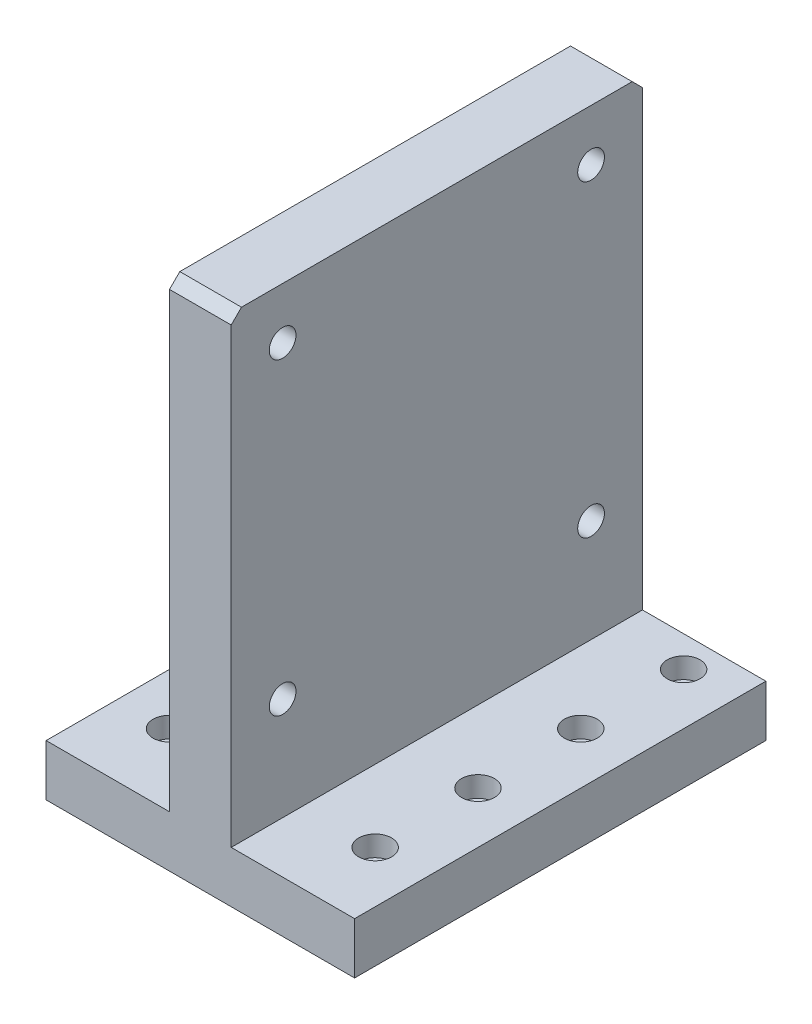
ISO-10303-21;
HEADER;
FILE_DESCRIPTION(('STEP AP214'),'2;1');
FILE_NAME('part.step','',(''),(''),'','','');
FILE_SCHEMA(('AUTOMOTIVE_DESIGN { 1 0 10303 214 1 1 1 1 }'));
ENDSEC;
DATA;
#1=APPLICATION_CONTEXT('core data for automotive mechanical design processes');
#2=APPLICATION_PROTOCOL_DEFINITION('international standard','automotive_design',2000,#1);
#3=PRODUCT_CONTEXT('',#1,'mechanical');
#4=PRODUCT('Part','Part','',(#3));
#5=PRODUCT_RELATED_PRODUCT_CATEGORY('part','',(#4));
#6=PRODUCT_DEFINITION_FORMATION('','',#4);
#7=PRODUCT_DEFINITION_CONTEXT('part definition',#1,'design');
#8=PRODUCT_DEFINITION('design','',#6,#7);
#9=PRODUCT_DEFINITION_SHAPE('','',#8);
#10=(LENGTH_UNIT() NAMED_UNIT(*) SI_UNIT(.MILLI.,.METRE.));
#11=(NAMED_UNIT(*) PLANE_ANGLE_UNIT() SI_UNIT($,.RADIAN.));
#12=(NAMED_UNIT(*) SI_UNIT($,.STERADIAN.) SOLID_ANGLE_UNIT());
#13=UNCERTAINTY_MEASURE_WITH_UNIT(LENGTH_MEASURE(1.E-05),#10,'distance_accuracy_value','');
#14=(GEOMETRIC_REPRESENTATION_CONTEXT(3) GLOBAL_UNCERTAINTY_ASSIGNED_CONTEXT((#13)) GLOBAL_UNIT_ASSIGNED_CONTEXT((#10,
#11,#12)) REPRESENTATION_CONTEXT('',''));
#15=CARTESIAN_POINT('',(0.,0.,0.));
#16=DIRECTION('',(0.,0.,1.));
#17=DIRECTION('',(1.,0.,0.));
#18=AXIS2_PLACEMENT_3D('',#15,#16,#17);
#19=CARTESIAN_POINT('',(75.,0.,200.));
#20=DIRECTION('',(0.,1.,0.));
#21=DIRECTION('',(-1.,0.,0.));
#22=AXIS2_PLACEMENT_3D('',#19,#20,#21);
#23=PLANE('',#22);
#24=CARTESIAN_POINT('',(0.,0.,90.));
#25=DIRECTION('',(0.,1.,0.));
#26=DIRECTION('',(0.,0.,1.));
#27=AXIS2_PLACEMENT_3D('',#24,#25,#26);
#28=CIRCLE('',#27,10.);
#29=CARTESIAN_POINT('',(0.,0.,100.));
#30=VERTEX_POINT('',#29);
#31=EDGE_CURVE('E148',#30,#30,#28,.T.);
#32=ORIENTED_EDGE('',*,*,#31,.T.);
#33=EDGE_LOOP('',(#32));
#34=FACE_BOUND('',#33,.T.);
#35=CARTESIAN_POINT('',(50.,0.,65.));
#36=DIRECTION('',(0.,1.,0.));
#37=DIRECTION('',(0.,0.,1.));
#38=AXIS2_PLACEMENT_3D('',#35,#36,#37);
#39=CIRCLE('',#38,5.00000000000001);
#40=CARTESIAN_POINT('',(50.,0.,70.));
#41=VERTEX_POINT('',#40);
#42=EDGE_CURVE('E305',#41,#41,#39,.T.);
#43=ORIENTED_EDGE('',*,*,#42,.T.);
#44=EDGE_LOOP('',(#43));
#45=FACE_BOUND('',#44,.T.);
#46=CARTESIAN_POINT('',(50.,0.,165.));
#47=DIRECTION('',(0.,1.,0.));
#48=DIRECTION('',(0.,0.,1.));
#49=AXIS2_PLACEMENT_3D('',#46,#47,#48);
#50=CIRCLE('',#49,5.00000000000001);
#51=CARTESIAN_POINT('',(50.,0.,170.));
#52=VERTEX_POINT('',#51);
#53=EDGE_CURVE('E311',#52,#52,#50,.T.);
#54=ORIENTED_EDGE('',*,*,#53,.T.);
#55=EDGE_LOOP('',(#54));
#56=FACE_BOUND('',#55,.T.);
#57=CARTESIAN_POINT('',(-50.,0.,115.));
#58=DIRECTION('',(0.,1.,0.));
#59=DIRECTION('',(0.,0.,1.));
#60=AXIS2_PLACEMENT_3D('',#57,#58,#59);
#61=CIRCLE('',#60,5.);
#62=CARTESIAN_POINT('',(-50.,0.,120.));
#63=VERTEX_POINT('',#62);
#64=EDGE_CURVE('E317',#63,#63,#61,.T.);
#65=ORIENTED_EDGE('',*,*,#64,.T.);
#66=EDGE_LOOP('',(#65));
#67=FACE_BOUND('',#66,.T.);
#68=CARTESIAN_POINT('',(-50.,0.,15.));
#69=DIRECTION('',(0.,1.,0.));
#70=DIRECTION('',(0.,0.,1.));
#71=AXIS2_PLACEMENT_3D('',#68,#69,#70);
#72=CIRCLE('',#71,5.);
#73=CARTESIAN_POINT('',(-50.,0.,20.));
#74=VERTEX_POINT('',#73);
#75=EDGE_CURVE('E220',#74,#74,#72,.T.);
#76=ORIENTED_EDGE('',*,*,#75,.T.);
#77=EDGE_LOOP('',(#76));
#78=FACE_BOUND('',#77,.T.);
#79=CARTESIAN_POINT('',(-50.,0.,65.));
#80=DIRECTION('',(0.,1.,0.));
#81=DIRECTION('',(0.,0.,1.));
#82=AXIS2_PLACEMENT_3D('',#79,#80,#81);
#83=CIRCLE('',#82,5.);
#84=CARTESIAN_POINT('',(-50.,0.,70.));
#85=VERTEX_POINT('',#84);
#86=EDGE_CURVE('E320',#85,#85,#83,.T.);
#87=ORIENTED_EDGE('',*,*,#86,.T.);
#88=EDGE_LOOP('',(#87));
#89=FACE_BOUND('',#88,.T.);
#90=CARTESIAN_POINT('',(-50.,0.,165.));
#91=DIRECTION('',(0.,1.,0.));
#92=DIRECTION('',(0.,0.,1.));
#93=AXIS2_PLACEMENT_3D('',#90,#91,#92);
#94=CIRCLE('',#93,5.);
#95=CARTESIAN_POINT('',(-50.,0.,170.));
#96=VERTEX_POINT('',#95);
#97=EDGE_CURVE('E314',#96,#96,#94,.T.);
#98=ORIENTED_EDGE('',*,*,#97,.T.);
#99=EDGE_LOOP('',(#98));
#100=FACE_BOUND('',#99,.T.);
#101=CARTESIAN_POINT('',(50.,0.,115.));
#102=DIRECTION('',(0.,1.,0.));
#103=DIRECTION('',(0.,0.,1.));
#104=AXIS2_PLACEMENT_3D('',#101,#102,#103);
#105=CIRCLE('',#104,5.00000000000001);
#106=CARTESIAN_POINT('',(50.,0.,120.));
#107=VERTEX_POINT('',#106);
#108=EDGE_CURVE('E308',#107,#107,#105,.T.);
#109=ORIENTED_EDGE('',*,*,#108,.T.);
#110=EDGE_LOOP('',(#109));
#111=FACE_BOUND('',#110,.T.);
#112=CARTESIAN_POINT('',(50.,0.,15.));
#113=DIRECTION('',(0.,1.,0.));
#114=DIRECTION('',(0.,0.,1.));
#115=AXIS2_PLACEMENT_3D('',#112,#113,#114);
#116=CIRCLE('',#115,5.);
#117=CARTESIAN_POINT('',(50.,0.,20.));
#118=VERTEX_POINT('',#117);
#119=EDGE_CURVE('E238',#118,#118,#116,.T.);
#120=ORIENTED_EDGE('',*,*,#119,.T.);
#121=EDGE_LOOP('',(#120));
#122=FACE_BOUND('',#121,.T.);
#123=DIRECTION('',(0.,0.,1.));
#124=VECTOR('',#123,1.);
#125=CARTESIAN_POINT('',(-10.,0.,0.));
#126=LINE('',#125,#124);
#127=CARTESIAN_POINT('',(-10.,0.,0.));
#128=VERTEX_POINT('',#127);
#129=CARTESIAN_POINT('',(-10.,0.,30.));
#130=VERTEX_POINT('',#129);
#131=EDGE_CURVE('E130',#128,#130,#126,.T.);
#132=ORIENTED_EDGE('',*,*,#131,.T.);
#133=CARTESIAN_POINT('',(0.,0.,30.));
#134=DIRECTION('',(0.,1.,0.));
#135=DIRECTION('',(0.,0.,1.));
#136=AXIS2_PLACEMENT_3D('',#133,#134,#135);
#137=CIRCLE('',#136,10.);
#138=CARTESIAN_POINT('',(10.,0.,30.));
#139=VERTEX_POINT('',#138);
#140=EDGE_CURVE('E138',#130,#139,#137,.T.);
#141=ORIENTED_EDGE('',*,*,#140,.T.);
#142=DIRECTION('',(0.,0.,-1.));
#143=VECTOR('',#142,1.);
#144=CARTESIAN_POINT('',(10.,0.,0.));
#145=LINE('',#144,#143);
#146=CARTESIAN_POINT('',(10.,0.,0.));
#147=VERTEX_POINT('',#146);
#148=EDGE_CURVE('E378',#139,#147,#145,.T.);
#149=ORIENTED_EDGE('',*,*,#148,.T.);
#150=DIRECTION('',(1.,0.,0.));
#151=VECTOR('',#150,1.);
#152=CARTESIAN_POINT('',(75.,0.,0.));
#153=LINE('',#152,#151);
#154=CARTESIAN_POINT('',(75.,0.,0.));
#155=VERTEX_POINT('',#154);
#156=EDGE_CURVE('E155',#147,#155,#153,.T.);
#157=ORIENTED_EDGE('',*,*,#156,.T.);
#158=DIRECTION('',(0.,0.,-1.));
#159=VECTOR('',#158,1.);
#160=CARTESIAN_POINT('',(75.,0.,200.));
#161=LINE('',#160,#159);
#162=CARTESIAN_POINT('',(75.,0.,200.));
#163=VERTEX_POINT('',#162);
#164=EDGE_CURVE('E193',#163,#155,#161,.T.);
#165=ORIENTED_EDGE('',*,*,#164,.F.);
#166=DIRECTION('',(1.,0.,0.));
#167=VECTOR('',#166,1.);
#168=CARTESIAN_POINT('',(75.,0.,200.));
#169=LINE('',#168,#167);
#170=CARTESIAN_POINT('',(-75.,0.,200.));
#171=VERTEX_POINT('',#170);
#172=EDGE_CURVE('E172',#171,#163,#169,.T.);
#173=ORIENTED_EDGE('',*,*,#172,.F.);
#174=DIRECTION('',(0.,0.,-1.));
#175=VECTOR('',#174,1.);
#176=CARTESIAN_POINT('',(-75.,0.,200.));
#177=LINE('',#176,#175);
#178=CARTESIAN_POINT('',(-75.,0.,0.));
#179=VERTEX_POINT('',#178);
#180=EDGE_CURVE('E153',#171,#179,#177,.T.);
#181=ORIENTED_EDGE('',*,*,#180,.T.);
#182=EDGE_CURVE('E144',#179,#128,#153,.T.);
#183=ORIENTED_EDGE('',*,*,#182,.T.);
#184=EDGE_LOOP('',(#132,#141,#149,#157,#165,#173,#181,#183));
#185=FACE_BOUND('',#184,.T.);
#186=ADVANCED_FACE('F29',(#34,#45,#56,#67,#78,#89,#100,#111,#122,#185),#23,.F.);
#187=CARTESIAN_POINT('',(-15.,250.,0.));
#188=DIRECTION('',(0.,0.,-1.));
#189=DIRECTION('',(-1.,0.,0.));
#190=AXIS2_PLACEMENT_3D('',#187,#188,#189);
#191=PLANE('',#190);
#192=DIRECTION('',(-1.,0.,0.));
#193=VECTOR('',#192,1.);
#194=CARTESIAN_POINT('',(-10.,5.,0.));
#195=LINE('',#194,#193);
#196=CARTESIAN_POINT('',(10.,5.,0.));
#197=VERTEX_POINT('',#196);
#198=CARTESIAN_POINT('',(-10.,5.,0.));
#199=VERTEX_POINT('',#198);
#200=EDGE_CURVE('E147',#197,#199,#195,.T.);
#201=ORIENTED_EDGE('',*,*,#200,.T.);
#202=DIRECTION('',(0.,-1.,0.));
#203=VECTOR('',#202,1.);
#204=CARTESIAN_POINT('',(-10.,5.,0.));
#205=LINE('',#204,#203);
#206=EDGE_CURVE('E46',#199,#128,#205,.T.);
#207=ORIENTED_EDGE('',*,*,#206,.T.);
#208=ORIENTED_EDGE('',*,*,#182,.F.);
#209=DIRECTION('',(0.,-1.,0.));
#210=VECTOR('',#209,1.);
#211=CARTESIAN_POINT('',(-75.,0.,0.));
#212=LINE('',#211,#210);
#213=CARTESIAN_POINT('',(-75.,25.,0.));
#214=VERTEX_POINT('',#213);
#215=EDGE_CURVE('E159',#214,#179,#212,.T.);
#216=ORIENTED_EDGE('',*,*,#215,.F.);
#217=DIRECTION('',(-1.,0.,0.));
#218=VECTOR('',#217,1.);
#219=CARTESIAN_POINT('',(-75.,25.,0.));
#220=LINE('',#219,#218);
#221=CARTESIAN_POINT('',(-15.,25.,0.));
#222=VERTEX_POINT('',#221);
#223=EDGE_CURVE('E334',#222,#214,#220,.T.);
#224=ORIENTED_EDGE('',*,*,#223,.F.);
#225=DIRECTION('',(0.,-1.,0.));
#226=VECTOR('',#225,1.);
#227=CARTESIAN_POINT('',(-15.,25.,0.));
#228=LINE('',#227,#226);
#229=CARTESIAN_POINT('',(-15.,245.,0.));
#230=VERTEX_POINT('',#229);
#231=EDGE_CURVE('E333',#230,#222,#228,.T.);
#232=ORIENTED_EDGE('',*,*,#231,.F.);
#233=DIRECTION('',(1.,0.,0.));
#234=VECTOR('',#233,1.);
#235=CARTESIAN_POINT('',(15.,245.,0.));
#236=LINE('',#235,#234);
#237=CARTESIAN_POINT('',(15.,245.,0.));
#238=VERTEX_POINT('',#237);
#239=EDGE_CURVE('E11',#230,#238,#236,.T.);
#240=ORIENTED_EDGE('',*,*,#239,.T.);
#241=DIRECTION('',(0.,1.,0.));
#242=VECTOR('',#241,1.);
#243=CARTESIAN_POINT('',(15.,250.,0.));
#244=LINE('',#243,#242);
#245=CARTESIAN_POINT('',(15.,25.,0.));
#246=VERTEX_POINT('',#245);
#247=EDGE_CURVE('E164',#246,#238,#244,.T.);
#248=ORIENTED_EDGE('',*,*,#247,.F.);
#249=DIRECTION('',(-1.,0.,0.));
#250=VECTOR('',#249,1.);
#251=CARTESIAN_POINT('',(15.,25.,0.));
#252=LINE('',#251,#250);
#253=CARTESIAN_POINT('',(75.,25.,0.));
#254=VERTEX_POINT('',#253);
#255=EDGE_CURVE('E157',#254,#246,#252,.T.);
#256=ORIENTED_EDGE('',*,*,#255,.F.);
#257=DIRECTION('',(0.,1.,0.));
#258=VECTOR('',#257,1.);
#259=CARTESIAN_POINT('',(75.,25.,0.));
#260=LINE('',#259,#258);
#261=EDGE_CURVE('E154',#155,#254,#260,.T.);
#262=ORIENTED_EDGE('',*,*,#261,.F.);
#263=ORIENTED_EDGE('',*,*,#156,.F.);
#264=DIRECTION('',(0.,-1.,0.));
#265=VECTOR('',#264,1.);
#266=CARTESIAN_POINT('',(10.,5.,0.));
#267=LINE('',#266,#265);
#268=EDGE_CURVE('E379',#197,#147,#267,.T.);
#269=ORIENTED_EDGE('',*,*,#268,.F.);
#270=EDGE_LOOP('',(#201,#207,#208,#216,#224,#232,#240,#248,#256,#262,#263,#269));
#271=FACE_BOUND('',#270,.T.);
#272=ADVANCED_FACE('F142',(#271),#191,.T.);
#273=CARTESIAN_POINT('',(-50.,30.,15.));
#274=DIRECTION('',(0.,-1.,0.));
#275=DIRECTION('',(0.,0.,-1.));
#276=AXIS2_PLACEMENT_3D('',#273,#274,#275);
#277=CYLINDRICAL_SURFACE('',#276,5.);
#278=ORIENTED_EDGE('',*,*,#75,.F.);
#279=EDGE_LOOP('',(#278));
#280=FACE_BOUND('',#279,.T.);
#281=CARTESIAN_POINT('',(-50.,15.,15.));
#282=DIRECTION('',(0.,1.,0.));
#283=DIRECTION('',(-1.,0.,0.));
#284=AXIS2_PLACEMENT_3D('',#281,#282,#283);
#285=CIRCLE('',#284,5.);
#286=CARTESIAN_POINT('',(-55.,15.,15.));
#287=VERTEX_POINT('',#286);
#288=EDGE_CURVE('E33',#287,#287,#285,.T.);
#289=ORIENTED_EDGE('',*,*,#288,.T.);
#290=EDGE_LOOP('',(#289));
#291=FACE_BOUND('',#290,.T.);
#292=ADVANCED_FACE('F404',(#280,#291),#277,.F.);
#293=CARTESIAN_POINT('',(50.,30.,15.));
#294=DIRECTION('',(0.,-1.,0.));
#295=DIRECTION('',(0.,0.,-1.));
#296=AXIS2_PLACEMENT_3D('',#293,#294,#295);
#297=CYLINDRICAL_SURFACE('',#296,5.);
#298=ORIENTED_EDGE('',*,*,#119,.F.);
#299=EDGE_LOOP('',(#298));
#300=FACE_BOUND('',#299,.T.);
#301=CARTESIAN_POINT('',(50.,15.,15.));
#302=DIRECTION('',(0.,1.,0.));
#303=DIRECTION('',(-1.,0.,0.));
#304=AXIS2_PLACEMENT_3D('',#301,#302,#303);
#305=CIRCLE('',#304,5.);
#306=CARTESIAN_POINT('',(45.,15.,15.));
#307=VERTEX_POINT('',#306);
#308=EDGE_CURVE('E264',#307,#307,#305,.T.);
#309=ORIENTED_EDGE('',*,*,#308,.T.);
#310=EDGE_LOOP('',(#309));
#311=FACE_BOUND('',#310,.T.);
#312=ADVANCED_FACE('F472',(#300,#311),#297,.F.);
#313=CARTESIAN_POINT('',(-50.,30.,65.));
#314=DIRECTION('',(0.,-1.,0.));
#315=DIRECTION('',(0.,0.,-1.));
#316=AXIS2_PLACEMENT_3D('',#313,#314,#315);
#317=CYLINDRICAL_SURFACE('',#316,5.);
#318=ORIENTED_EDGE('',*,*,#86,.F.);
#319=EDGE_LOOP('',(#318));
#320=FACE_BOUND('',#319,.T.);
#321=CARTESIAN_POINT('',(-50.,15.,65.));
#322=DIRECTION('',(0.,1.,0.));
#323=DIRECTION('',(-1.,0.,0.));
#324=AXIS2_PLACEMENT_3D('',#321,#322,#323);
#325=CIRCLE('',#324,5.);
#326=CARTESIAN_POINT('',(-55.,15.,65.));
#327=VERTEX_POINT('',#326);
#328=EDGE_CURVE('E260',#327,#327,#325,.T.);
#329=ORIENTED_EDGE('',*,*,#328,.T.);
#330=EDGE_LOOP('',(#329));
#331=FACE_BOUND('',#330,.T.);
#332=ADVANCED_FACE('F475',(#320,#331),#317,.F.);
#333=CARTESIAN_POINT('',(50.,30.,65.));
#334=DIRECTION('',(0.,-1.,0.));
#335=DIRECTION('',(0.,0.,-1.));
#336=AXIS2_PLACEMENT_3D('',#333,#334,#335);
#337=CYLINDRICAL_SURFACE('',#336,5.00000000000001);
#338=ORIENTED_EDGE('',*,*,#42,.F.);
#339=EDGE_LOOP('',(#338));
#340=FACE_BOUND('',#339,.T.);
#341=CARTESIAN_POINT('',(50.,15.,65.));
#342=DIRECTION('',(0.,1.,0.));
#343=DIRECTION('',(-1.,0.,0.));
#344=AXIS2_PLACEMENT_3D('',#341,#342,#343);
#345=CIRCLE('',#344,5.00000000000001);
#346=CARTESIAN_POINT('',(45.,15.,65.));
#347=VERTEX_POINT('',#346);
#348=EDGE_CURVE('E255',#347,#347,#345,.T.);
#349=ORIENTED_EDGE('',*,*,#348,.T.);
#350=EDGE_LOOP('',(#349));
#351=FACE_BOUND('',#350,.T.);
#352=ADVANCED_FACE('F477',(#340,#351),#337,.F.);
#353=CARTESIAN_POINT('',(-50.,30.,115.));
#354=DIRECTION('',(0.,-1.,0.));
#355=DIRECTION('',(0.,0.,-1.));
#356=AXIS2_PLACEMENT_3D('',#353,#354,#355);
#357=CYLINDRICAL_SURFACE('',#356,5.);
#358=ORIENTED_EDGE('',*,*,#64,.F.);
#359=EDGE_LOOP('',(#358));
#360=FACE_BOUND('',#359,.T.);
#361=CARTESIAN_POINT('',(-50.,15.,115.));
#362=DIRECTION('',(0.,1.,0.));
#363=DIRECTION('',(-1.,0.,0.));
#364=AXIS2_PLACEMENT_3D('',#361,#362,#363);
#365=CIRCLE('',#364,5.);
#366=CARTESIAN_POINT('',(-55.,15.,115.));
#367=VERTEX_POINT('',#366);
#368=EDGE_CURVE('E250',#367,#367,#365,.T.);
#369=ORIENTED_EDGE('',*,*,#368,.T.);
#370=EDGE_LOOP('',(#369));
#371=FACE_BOUND('',#370,.T.);
#372=ADVANCED_FACE('F480',(#360,#371),#357,.F.);
#373=CARTESIAN_POINT('',(50.,30.,115.));
#374=DIRECTION('',(0.,-1.,0.));
#375=DIRECTION('',(0.,0.,-1.));
#376=AXIS2_PLACEMENT_3D('',#373,#374,#375);
#377=CYLINDRICAL_SURFACE('',#376,5.00000000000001);
#378=ORIENTED_EDGE('',*,*,#108,.F.);
#379=EDGE_LOOP('',(#378));
#380=FACE_BOUND('',#379,.T.);
#381=CARTESIAN_POINT('',(50.,15.,115.));
#382=DIRECTION('',(0.,1.,0.));
#383=DIRECTION('',(-1.,0.,0.));
#384=AXIS2_PLACEMENT_3D('',#381,#382,#383);
#385=CIRCLE('',#384,5.00000000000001);
#386=CARTESIAN_POINT('',(45.,15.,115.));
#387=VERTEX_POINT('',#386);
#388=EDGE_CURVE('E245',#387,#387,#385,.T.);
#389=ORIENTED_EDGE('',*,*,#388,.T.);
#390=EDGE_LOOP('',(#389));
#391=FACE_BOUND('',#390,.T.);
#392=ADVANCED_FACE('F482',(#380,#391),#377,.F.);
#393=CARTESIAN_POINT('',(-50.,30.,165.));
#394=DIRECTION('',(0.,-1.,0.));
#395=DIRECTION('',(0.,0.,-1.));
#396=AXIS2_PLACEMENT_3D('',#393,#394,#395);
#397=CYLINDRICAL_SURFACE('',#396,5.);
#398=ORIENTED_EDGE('',*,*,#97,.F.);
#399=EDGE_LOOP('',(#398));
#400=FACE_BOUND('',#399,.T.);
#401=CARTESIAN_POINT('',(-50.,15.,165.));
#402=DIRECTION('',(0.,1.,0.));
#403=DIRECTION('',(-1.,0.,0.));
#404=AXIS2_PLACEMENT_3D('',#401,#402,#403);
#405=CIRCLE('',#404,5.);
#406=CARTESIAN_POINT('',(-55.,15.,165.));
#407=VERTEX_POINT('',#406);
#408=EDGE_CURVE('E240',#407,#407,#405,.T.);
#409=ORIENTED_EDGE('',*,*,#408,.T.);
#410=EDGE_LOOP('',(#409));
#411=FACE_BOUND('',#410,.T.);
#412=ADVANCED_FACE('F485',(#400,#411),#397,.F.);
#413=CARTESIAN_POINT('',(50.,30.,165.));
#414=DIRECTION('',(0.,-1.,0.));
#415=DIRECTION('',(0.,0.,-1.));
#416=AXIS2_PLACEMENT_3D('',#413,#414,#415);
#417=CYLINDRICAL_SURFACE('',#416,5.00000000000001);
#418=ORIENTED_EDGE('',*,*,#53,.F.);
#419=EDGE_LOOP('',(#418));
#420=FACE_BOUND('',#419,.T.);
#421=CARTESIAN_POINT('',(50.,15.,165.));
#422=DIRECTION('',(0.,1.,0.));
#423=DIRECTION('',(-1.,0.,0.));
#424=AXIS2_PLACEMENT_3D('',#421,#422,#423);
#425=CIRCLE('',#424,5.00000000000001);
#426=CARTESIAN_POINT('',(45.,15.,165.));
#427=VERTEX_POINT('',#426);
#428=EDGE_CURVE('E235',#427,#427,#425,.T.);
#429=ORIENTED_EDGE('',*,*,#428,.T.);
#430=EDGE_LOOP('',(#429));
#431=FACE_BOUND('',#430,.T.);
#432=ADVANCED_FACE('F440',(#420,#431),#417,.F.);
#433=CARTESIAN_POINT('',(15.,25.,200.));
#434=DIRECTION('',(0.,-1.,0.));
#435=DIRECTION('',(1.,0.,0.));
#436=AXIS2_PLACEMENT_3D('',#433,#434,#435);
#437=PLANE('',#436);
#438=CARTESIAN_POINT('',(50.,25.,15.));
#439=DIRECTION('',(0.,1.,0.));
#440=DIRECTION('',(-1.,0.,0.));
#441=AXIS2_PLACEMENT_3D('',#438,#439,#440);
#442=CIRCLE('',#441,8.);
#443=CARTESIAN_POINT('',(42.,25.,15.));
#444=VERTEX_POINT('',#443);
#445=EDGE_CURVE('E273',#444,#444,#442,.T.);
#446=ORIENTED_EDGE('',*,*,#445,.F.);
#447=EDGE_LOOP('',(#446));
#448=FACE_BOUND('',#447,.T.);
#449=CARTESIAN_POINT('',(50.,25.,65.));
#450=DIRECTION('',(0.,1.,0.));
#451=DIRECTION('',(-1.,0.,0.));
#452=AXIS2_PLACEMENT_3D('',#449,#450,#451);
#453=CIRCLE('',#452,8.);
#454=CARTESIAN_POINT('',(42.,25.,65.));
#455=VERTEX_POINT('',#454);
#456=EDGE_CURVE('E262',#455,#455,#453,.T.);
#457=ORIENTED_EDGE('',*,*,#456,.F.);
#458=EDGE_LOOP('',(#457));
#459=FACE_BOUND('',#458,.T.);
#460=CARTESIAN_POINT('',(50.,25.,115.));
#461=DIRECTION('',(0.,1.,0.));
#462=DIRECTION('',(-1.,0.,0.));
#463=AXIS2_PLACEMENT_3D('',#460,#461,#462);
#464=CIRCLE('',#463,8.);
#465=CARTESIAN_POINT('',(42.,25.,115.));
#466=VERTEX_POINT('',#465);
#467=EDGE_CURVE('E253',#466,#466,#464,.T.);
#468=ORIENTED_EDGE('',*,*,#467,.F.);
#469=EDGE_LOOP('',(#468));
#470=FACE_BOUND('',#469,.T.);
#471=CARTESIAN_POINT('',(50.,25.,165.));
#472=DIRECTION('',(0.,1.,0.));
#473=DIRECTION('',(-1.,0.,0.));
#474=AXIS2_PLACEMENT_3D('',#471,#472,#473);
#475=CIRCLE('',#474,8.);
#476=CARTESIAN_POINT('',(42.,25.,165.));
#477=VERTEX_POINT('',#476);
#478=EDGE_CURVE('E243',#477,#477,#475,.T.);
#479=ORIENTED_EDGE('',*,*,#478,.F.);
#480=EDGE_LOOP('',(#479));
#481=FACE_BOUND('',#480,.T.);
#482=ORIENTED_EDGE('',*,*,#255,.T.);
#483=DIRECTION('',(0.,0.,-1.));
#484=VECTOR('',#483,1.);
#485=CARTESIAN_POINT('',(15.,25.,200.));
#486=LINE('',#485,#484);
#487=CARTESIAN_POINT('',(15.,25.,200.));
#488=VERTEX_POINT('',#487);
#489=EDGE_CURVE('E187',#488,#246,#486,.T.);
#490=ORIENTED_EDGE('',*,*,#489,.F.);
#491=DIRECTION('',(-1.,0.,0.));
#492=VECTOR('',#491,1.);
#493=CARTESIAN_POINT('',(15.,25.,200.));
#494=LINE('',#493,#492);
#495=CARTESIAN_POINT('',(75.,25.,200.));
#496=VERTEX_POINT('',#495);
#497=EDGE_CURVE('E176',#496,#488,#494,.T.);
#498=ORIENTED_EDGE('',*,*,#497,.F.);
#499=DIRECTION('',(0.,0.,-1.));
#500=VECTOR('',#499,1.);
#501=CARTESIAN_POINT('',(75.,25.,200.));
#502=LINE('',#501,#500);
#503=EDGE_CURVE('E190',#496,#254,#502,.T.);
#504=ORIENTED_EDGE('',*,*,#503,.T.);
#505=EDGE_LOOP('',(#482,#490,#498,#504));
#506=FACE_BOUND('',#505,.T.);
#507=ADVANCED_FACE('F370',(#448,#459,#470,#481,#506),#437,.F.);
#508=CARTESIAN_POINT('',(-75.,25.,200.));
#509=DIRECTION('',(0.,-1.,0.));
#510=DIRECTION('',(0.,0.,-1.));
#511=AXIS2_PLACEMENT_3D('',#508,#509,#510);
#512=PLANE('',#511);
#513=CARTESIAN_POINT('',(-50.,25.,15.));
#514=DIRECTION('',(0.,1.,0.));
#515=DIRECTION('',(-1.,0.,0.));
#516=AXIS2_PLACEMENT_3D('',#513,#514,#515);
#517=CIRCLE('',#516,8.);
#518=CARTESIAN_POINT('',(-58.,25.,15.));
#519=VERTEX_POINT('',#518);
#520=EDGE_CURVE('E395',#519,#519,#517,.T.);
#521=ORIENTED_EDGE('',*,*,#520,.F.);
#522=EDGE_LOOP('',(#521));
#523=FACE_BOUND('',#522,.T.);
#524=CARTESIAN_POINT('',(-50.,25.,65.));
#525=DIRECTION('',(0.,1.,0.));
#526=DIRECTION('',(-1.,0.,0.));
#527=AXIS2_PLACEMENT_3D('',#524,#525,#526);
#528=CIRCLE('',#527,8.);
#529=CARTESIAN_POINT('',(-58.,25.,65.));
#530=VERTEX_POINT('',#529);
#531=EDGE_CURVE('E266',#530,#530,#528,.T.);
#532=ORIENTED_EDGE('',*,*,#531,.F.);
#533=EDGE_LOOP('',(#532));
#534=FACE_BOUND('',#533,.T.);
#535=CARTESIAN_POINT('',(-50.,25.,115.));
#536=DIRECTION('',(0.,1.,0.));
#537=DIRECTION('',(-1.,0.,0.));
#538=AXIS2_PLACEMENT_3D('',#535,#536,#537);
#539=CIRCLE('',#538,8.);
#540=CARTESIAN_POINT('',(-58.,25.,115.));
#541=VERTEX_POINT('',#540);
#542=EDGE_CURVE('E258',#541,#541,#539,.T.);
#543=ORIENTED_EDGE('',*,*,#542,.F.);
#544=EDGE_LOOP('',(#543));
#545=FACE_BOUND('',#544,.T.);
#546=CARTESIAN_POINT('',(-50.,25.,165.));
#547=DIRECTION('',(0.,1.,0.));
#548=DIRECTION('',(-1.,0.,0.));
#549=AXIS2_PLACEMENT_3D('',#546,#547,#548);
#550=CIRCLE('',#549,8.);
#551=CARTESIAN_POINT('',(-58.,25.,165.));
#552=VERTEX_POINT('',#551);
#553=EDGE_CURVE('E248',#552,#552,#550,.T.);
#554=ORIENTED_EDGE('',*,*,#553,.F.);
#555=EDGE_LOOP('',(#554));
#556=FACE_BOUND('',#555,.T.);
#557=ORIENTED_EDGE('',*,*,#223,.T.);
#558=DIRECTION('',(0.,0.,-1.));
#559=VECTOR('',#558,1.);
#560=CARTESIAN_POINT('',(-75.,25.,200.));
#561=LINE('',#560,#559);
#562=CARTESIAN_POINT('',(-75.,25.,200.));
#563=VERTEX_POINT('',#562);
#564=EDGE_CURVE('E197',#563,#214,#561,.T.);
#565=ORIENTED_EDGE('',*,*,#564,.F.);
#566=DIRECTION('',(-1.,0.,0.));
#567=VECTOR('',#566,1.);
#568=CARTESIAN_POINT('',(-75.,25.,200.));
#569=LINE('',#568,#567);
#570=CARTESIAN_POINT('',(-15.,25.,200.));
#571=VERTEX_POINT('',#570);
#572=EDGE_CURVE('E168',#571,#563,#569,.T.);
#573=ORIENTED_EDGE('',*,*,#572,.F.);
#574=DIRECTION('',(0.,0.,-1.));
#575=VECTOR('',#574,1.);
#576=CARTESIAN_POINT('',(-15.,25.,200.));
#577=LINE('',#576,#575);
#578=EDGE_CURVE('E200',#571,#222,#577,.T.);
#579=ORIENTED_EDGE('',*,*,#578,.T.);
#580=EDGE_LOOP('',(#557,#565,#573,#579));
#581=FACE_BOUND('',#580,.T.);
#582=ADVANCED_FACE('F343',(#523,#534,#545,#556,#581),#512,.F.);
#583=CARTESIAN_POINT('',(-15.,25.,200.));
#584=DIRECTION('',(1.,0.,0.));
#585=DIRECTION('',(0.,0.,-1.));
#586=AXIS2_PLACEMENT_3D('',#583,#584,#585);
#587=PLANE('',#586);
#588=CARTESIAN_POINT('',(-15.,75.,175.));
#589=DIRECTION('',(1.,0.,0.));
#590=DIRECTION('',(0.,0.,-1.));
#591=AXIS2_PLACEMENT_3D('',#588,#589,#590);
#592=CIRCLE('',#591,6.50000000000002);
#593=CARTESIAN_POINT('',(-15.,75.,168.5));
#594=VERTEX_POINT('',#593);
#595=EDGE_CURVE('E216',#594,#594,#592,.T.);
#596=ORIENTED_EDGE('',*,*,#595,.T.);
#597=EDGE_LOOP('',(#596));
#598=FACE_BOUND('',#597,.T.);
#599=CARTESIAN_POINT('',(-15.,75.,25.));
#600=DIRECTION('',(1.,0.,0.));
#601=DIRECTION('',(0.,0.,-1.));
#602=AXIS2_PLACEMENT_3D('',#599,#600,#601);
#603=CIRCLE('',#602,6.50000000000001);
#604=CARTESIAN_POINT('',(-15.,75.,18.5));
#605=VERTEX_POINT('',#604);
#606=EDGE_CURVE('E212',#605,#605,#603,.T.);
#607=ORIENTED_EDGE('',*,*,#606,.T.);
#608=EDGE_LOOP('',(#607));
#609=FACE_BOUND('',#608,.T.);
#610=CARTESIAN_POINT('',(-15.,225.,175.));
#611=DIRECTION('',(1.,0.,0.));
#612=DIRECTION('',(0.,0.,-1.));
#613=AXIS2_PLACEMENT_3D('',#610,#611,#612);
#614=CIRCLE('',#613,6.50000000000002);
#615=CARTESIAN_POINT('',(-15.,225.,168.5));
#616=VERTEX_POINT('',#615);
#617=EDGE_CURVE('E208',#616,#616,#614,.T.);
#618=ORIENTED_EDGE('',*,*,#617,.T.);
#619=EDGE_LOOP('',(#618));
#620=FACE_BOUND('',#619,.T.);
#621=CARTESIAN_POINT('',(-15.,225.,25.));
#622=DIRECTION('',(1.,0.,0.));
#623=DIRECTION('',(0.,0.,-1.));
#624=AXIS2_PLACEMENT_3D('',#621,#622,#623);
#625=CIRCLE('',#624,6.5);
#626=CARTESIAN_POINT('',(-15.,225.,18.5));
#627=VERTEX_POINT('',#626);
#628=EDGE_CURVE('E207',#627,#627,#625,.T.);
#629=ORIENTED_EDGE('',*,*,#628,.T.);
#630=EDGE_LOOP('',(#629));
#631=FACE_BOUND('',#630,.T.);
#632=DIRECTION('',(0.,-1.,0.));
#633=VECTOR('',#632,1.);
#634=CARTESIAN_POINT('',(-15.,25.,200.));
#635=LINE('',#634,#633);
#636=CARTESIAN_POINT('',(-15.,245.,200.));
#637=VERTEX_POINT('',#636);
#638=EDGE_CURVE('E166',#637,#571,#635,.T.);
#639=ORIENTED_EDGE('',*,*,#638,.F.);
#640=DIRECTION('',(0.,-0.707106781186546,0.707106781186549));
#641=VECTOR('',#640,1.);
#642=CARTESIAN_POINT('',(-15.,245.,200.));
#643=LINE('',#642,#641);
#644=CARTESIAN_POINT('',(-15.,250.,195.));
#645=VERTEX_POINT('',#644);
#646=EDGE_CURVE('E225',#637,#645,#643,.F.);
#647=ORIENTED_EDGE('',*,*,#646,.T.);
#648=DIRECTION('',(0.,0.,-1.));
#649=VECTOR('',#648,1.);
#650=CARTESIAN_POINT('',(-15.,250.,200.));
#651=LINE('',#650,#649);
#652=CARTESIAN_POINT('',(-15.,250.,5.));
#653=VERTEX_POINT('',#652);
#654=EDGE_CURVE('E181',#645,#653,#651,.T.);
#655=ORIENTED_EDGE('',*,*,#654,.T.);
#656=DIRECTION('',(0.,-0.707106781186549,-0.707106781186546));
#657=VECTOR('',#656,1.);
#658=CARTESIAN_POINT('',(-15.,250.,5.));
#659=LINE('',#658,#657);
#660=EDGE_CURVE('E223',#653,#230,#659,.T.);
#661=ORIENTED_EDGE('',*,*,#660,.T.);
#662=ORIENTED_EDGE('',*,*,#231,.T.);
#663=ORIENTED_EDGE('',*,*,#578,.F.);
#664=EDGE_LOOP('',(#639,#647,#655,#661,#662,#663));
#665=FACE_BOUND('',#664,.T.);
#666=ADVANCED_FACE('F31',(#598,#609,#620,#631,#665),#587,.F.);
#667=CARTESIAN_POINT('',(-75.,0.,200.));
#668=DIRECTION('',(1.,0.,0.));
#669=DIRECTION('',(0.,0.,-1.));
#670=AXIS2_PLACEMENT_3D('',#667,#668,#669);
#671=PLANE('',#670);
#672=ORIENTED_EDGE('',*,*,#215,.T.);
#673=ORIENTED_EDGE('',*,*,#180,.F.);
#674=DIRECTION('',(0.,-1.,0.));
#675=VECTOR('',#674,1.);
#676=CARTESIAN_POINT('',(-75.,0.,200.));
#677=LINE('',#676,#675);
#678=EDGE_CURVE('E170',#563,#171,#677,.T.);
#679=ORIENTED_EDGE('',*,*,#678,.F.);
#680=ORIENTED_EDGE('',*,*,#564,.T.);
#681=EDGE_LOOP('',(#672,#673,#679,#680));
#682=FACE_BOUND('',#681,.T.);
#683=ADVANCED_FACE('F339',(#682),#671,.F.);
#684=CARTESIAN_POINT('',(75.,25.,200.));
#685=DIRECTION('',(-1.,0.,0.));
#686=DIRECTION('',(0.,0.,1.));
#687=AXIS2_PLACEMENT_3D('',#684,#685,#686);
#688=PLANE('',#687);
#689=ORIENTED_EDGE('',*,*,#261,.T.);
#690=ORIENTED_EDGE('',*,*,#503,.F.);
#691=DIRECTION('',(0.,1.,0.));
#692=VECTOR('',#691,1.);
#693=CARTESIAN_POINT('',(75.,25.,200.));
#694=LINE('',#693,#692);
#695=EDGE_CURVE('E174',#163,#496,#694,.T.);
#696=ORIENTED_EDGE('',*,*,#695,.F.);
#697=ORIENTED_EDGE('',*,*,#164,.T.);
#698=EDGE_LOOP('',(#689,#690,#696,#697));
#699=FACE_BOUND('',#698,.T.);
#700=ADVANCED_FACE('F374',(#699),#688,.F.);
#701=CARTESIAN_POINT('',(15.,250.,200.));
#702=DIRECTION('',(-1.,0.,0.));
#703=DIRECTION('',(0.,-1.,0.));
#704=AXIS2_PLACEMENT_3D('',#701,#702,#703);
#705=PLANE('',#704);
#706=CARTESIAN_POINT('',(15.,75.,175.));
#707=DIRECTION('',(-1.,0.,0.));
#708=DIRECTION('',(0.,-1.,0.));
#709=AXIS2_PLACEMENT_3D('',#706,#707,#708);
#710=CIRCLE('',#709,6.50000000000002);
#711=CARTESIAN_POINT('',(15.,68.5,175.));
#712=VERTEX_POINT('',#711);
#713=EDGE_CURVE('E217',#712,#712,#710,.T.);
#714=ORIENTED_EDGE('',*,*,#713,.T.);
#715=EDGE_LOOP('',(#714));
#716=FACE_BOUND('',#715,.T.);
#717=CARTESIAN_POINT('',(15.,75.,25.));
#718=DIRECTION('',(-1.,0.,0.));
#719=DIRECTION('',(0.,-1.,0.));
#720=AXIS2_PLACEMENT_3D('',#717,#718,#719);
#721=CIRCLE('',#720,6.50000000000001);
#722=CARTESIAN_POINT('',(15.,68.5,25.));
#723=VERTEX_POINT('',#722);
#724=EDGE_CURVE('E213',#723,#723,#721,.T.);
#725=ORIENTED_EDGE('',*,*,#724,.T.);
#726=EDGE_LOOP('',(#725));
#727=FACE_BOUND('',#726,.T.);
#728=CARTESIAN_POINT('',(15.,225.,175.));
#729=DIRECTION('',(-1.,0.,0.));
#730=DIRECTION('',(0.,-1.,0.));
#731=AXIS2_PLACEMENT_3D('',#728,#729,#730);
#732=CIRCLE('',#731,6.50000000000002);
#733=CARTESIAN_POINT('',(15.,218.5,175.));
#734=VERTEX_POINT('',#733);
#735=EDGE_CURVE('E209',#734,#734,#732,.T.);
#736=ORIENTED_EDGE('',*,*,#735,.T.);
#737=EDGE_LOOP('',(#736));
#738=FACE_BOUND('',#737,.T.);
#739=CARTESIAN_POINT('',(15.,225.,25.));
#740=DIRECTION('',(-1.,0.,0.));
#741=DIRECTION('',(0.,-1.,0.));
#742=AXIS2_PLACEMENT_3D('',#739,#740,#741);
#743=CIRCLE('',#742,6.5);
#744=CARTESIAN_POINT('',(15.,218.5,25.));
#745=VERTEX_POINT('',#744);
#746=EDGE_CURVE('E204',#745,#745,#743,.T.);
#747=ORIENTED_EDGE('',*,*,#746,.T.);
#748=EDGE_LOOP('',(#747));
#749=FACE_BOUND('',#748,.T.);
#750=DIRECTION('',(0.,0.,-1.));
#751=VECTOR('',#750,1.);
#752=CARTESIAN_POINT('',(15.,250.,200.));
#753=LINE('',#752,#751);
#754=CARTESIAN_POINT('',(15.,250.,195.));
#755=VERTEX_POINT('',#754);
#756=CARTESIAN_POINT('',(15.,250.,5.));
#757=VERTEX_POINT('',#756);
#758=EDGE_CURVE('E184',#755,#757,#753,.T.);
#759=ORIENTED_EDGE('',*,*,#758,.F.);
#760=DIRECTION('',(0.,0.707106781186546,-0.707106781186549));
#761=VECTOR('',#760,1.);
#762=CARTESIAN_POINT('',(15.,245.,200.));
#763=LINE('',#762,#761);
#764=CARTESIAN_POINT('',(15.,245.,200.));
#765=VERTEX_POINT('',#764);
#766=EDGE_CURVE('E38',#755,#765,#763,.F.);
#767=ORIENTED_EDGE('',*,*,#766,.T.);
#768=DIRECTION('',(0.,1.,0.));
#769=VECTOR('',#768,1.);
#770=CARTESIAN_POINT('',(15.,250.,200.));
#771=LINE('',#770,#769);
#772=EDGE_CURVE('E178',#488,#765,#771,.T.);
#773=ORIENTED_EDGE('',*,*,#772,.F.);
#774=ORIENTED_EDGE('',*,*,#489,.T.);
#775=ORIENTED_EDGE('',*,*,#247,.T.);
#776=DIRECTION('',(0.,0.707106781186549,0.707106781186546));
#777=VECTOR('',#776,1.);
#778=CARTESIAN_POINT('',(15.,250.,5.00000000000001));
#779=LINE('',#778,#777);
#780=EDGE_CURVE('E232',#238,#757,#779,.T.);
#781=ORIENTED_EDGE('',*,*,#780,.T.);
#782=EDGE_LOOP('',(#759,#767,#773,#774,#775,#781));
#783=FACE_BOUND('',#782,.T.);
#784=ADVANCED_FACE('F357',(#716,#727,#738,#749,#783),#705,.F.);
#785=CARTESIAN_POINT('',(-15.,250.,200.));
#786=DIRECTION('',(0.,-1.,0.));
#787=DIRECTION('',(0.,0.,-1.));
#788=AXIS2_PLACEMENT_3D('',#785,#786,#787);
#789=PLANE('',#788);
#790=ORIENTED_EDGE('',*,*,#654,.F.);
#791=DIRECTION('',(1.,0.,0.));
#792=VECTOR('',#791,1.);
#793=CARTESIAN_POINT('',(-15.,250.,195.));
#794=LINE('',#793,#792);
#795=EDGE_CURVE('E230',#645,#755,#794,.T.);
#796=ORIENTED_EDGE('',*,*,#795,.T.);
#797=ORIENTED_EDGE('',*,*,#758,.T.);
#798=DIRECTION('',(-1.,0.,0.));
#799=VECTOR('',#798,1.);
#800=CARTESIAN_POINT('',(-15.,250.,5.));
#801=LINE('',#800,#799);
#802=EDGE_CURVE('E227',#757,#653,#801,.T.);
#803=ORIENTED_EDGE('',*,*,#802,.T.);
#804=EDGE_LOOP('',(#790,#796,#797,#803));
#805=FACE_BOUND('',#804,.T.);
#806=ADVANCED_FACE('F352',(#805),#789,.F.);
#807=CARTESIAN_POINT('',(-15.,250.,200.));
#808=DIRECTION('',(0.,0.,-1.));
#809=DIRECTION('',(-1.,0.,0.));
#810=AXIS2_PLACEMENT_3D('',#807,#808,#809);
#811=PLANE('',#810);
#812=ORIENTED_EDGE('',*,*,#772,.T.);
#813=DIRECTION('',(-1.,0.,0.));
#814=VECTOR('',#813,1.);
#815=CARTESIAN_POINT('',(-15.,245.,200.));
#816=LINE('',#815,#814);
#817=EDGE_CURVE('E203',#765,#637,#816,.T.);
#818=ORIENTED_EDGE('',*,*,#817,.T.);
#819=ORIENTED_EDGE('',*,*,#638,.T.);
#820=ORIENTED_EDGE('',*,*,#572,.T.);
#821=ORIENTED_EDGE('',*,*,#678,.T.);
#822=ORIENTED_EDGE('',*,*,#172,.T.);
#823=ORIENTED_EDGE('',*,*,#695,.T.);
#824=ORIENTED_EDGE('',*,*,#497,.T.);
#825=EDGE_LOOP('',(#812,#818,#819,#820,#821,#822,#823,#824));
#826=FACE_BOUND('',#825,.T.);
#827=ADVANCED_FACE('F363',(#826),#811,.F.);
#828=CARTESIAN_POINT('',(-100.,225.,25.));
#829=DIRECTION('',(1.,0.,0.));
#830=DIRECTION('',(0.,0.,-1.));
#831=AXIS2_PLACEMENT_3D('',#828,#829,#830);
#832=CYLINDRICAL_SURFACE('',#831,6.5);
#833=ORIENTED_EDGE('',*,*,#746,.F.);
#834=EDGE_LOOP('',(#833));
#835=FACE_BOUND('',#834,.T.);
#836=ORIENTED_EDGE('',*,*,#628,.F.);
#837=EDGE_LOOP('',(#836));
#838=FACE_BOUND('',#837,.T.);
#839=ADVANCED_FACE('F517',(#835,#838),#832,.F.);
#840=CARTESIAN_POINT('',(-100.,225.,175.));
#841=DIRECTION('',(1.,0.,0.));
#842=DIRECTION('',(0.,0.,-1.));
#843=AXIS2_PLACEMENT_3D('',#840,#841,#842);
#844=CYLINDRICAL_SURFACE('',#843,6.50000000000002);
#845=ORIENTED_EDGE('',*,*,#735,.F.);
#846=EDGE_LOOP('',(#845));
#847=FACE_BOUND('',#846,.T.);
#848=ORIENTED_EDGE('',*,*,#617,.F.);
#849=EDGE_LOOP('',(#848));
#850=FACE_BOUND('',#849,.T.);
#851=ADVANCED_FACE('F513',(#847,#850),#844,.F.);
#852=CARTESIAN_POINT('',(-100.,75.,25.));
#853=DIRECTION('',(1.,0.,0.));
#854=DIRECTION('',(0.,0.,-1.));
#855=AXIS2_PLACEMENT_3D('',#852,#853,#854);
#856=CYLINDRICAL_SURFACE('',#855,6.50000000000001);
#857=ORIENTED_EDGE('',*,*,#724,.F.);
#858=EDGE_LOOP('',(#857));
#859=FACE_BOUND('',#858,.T.);
#860=ORIENTED_EDGE('',*,*,#606,.F.);
#861=EDGE_LOOP('',(#860));
#862=FACE_BOUND('',#861,.T.);
#863=ADVANCED_FACE('F509',(#859,#862),#856,.F.);
#864=CARTESIAN_POINT('',(-100.,75.,175.));
#865=DIRECTION('',(1.,0.,0.));
#866=DIRECTION('',(0.,0.,-1.));
#867=AXIS2_PLACEMENT_3D('',#864,#865,#866);
#868=CYLINDRICAL_SURFACE('',#867,6.50000000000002);
#869=ORIENTED_EDGE('',*,*,#713,.F.);
#870=EDGE_LOOP('',(#869));
#871=FACE_BOUND('',#870,.T.);
#872=ORIENTED_EDGE('',*,*,#595,.F.);
#873=EDGE_LOOP('',(#872));
#874=FACE_BOUND('',#873,.T.);
#875=ADVANCED_FACE('F506',(#871,#874),#868,.F.);
#876=CARTESIAN_POINT('',(-15.,245.,200.));
#877=DIRECTION('',(0.,-0.707106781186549,-0.707106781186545));
#878=DIRECTION('',(0.,0.707106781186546,-0.707106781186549));
#879=AXIS2_PLACEMENT_3D('',#876,#877,#878);
#880=PLANE('',#879);
#881=ORIENTED_EDGE('',*,*,#766,.F.);
#882=ORIENTED_EDGE('',*,*,#795,.F.);
#883=ORIENTED_EDGE('',*,*,#646,.F.);
#884=ORIENTED_EDGE('',*,*,#817,.F.);
#885=EDGE_LOOP('',(#881,#882,#883,#884));
#886=FACE_BOUND('',#885,.T.);
#887=ADVANCED_FACE('F361',(#886),#880,.F.);
#888=CARTESIAN_POINT('',(-15.,250.,5.));
#889=DIRECTION('',(0.,0.707106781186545,-0.707106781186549));
#890=DIRECTION('',(0.,0.707106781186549,0.707106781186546));
#891=AXIS2_PLACEMENT_3D('',#888,#889,#890);
#892=PLANE('',#891);
#893=ORIENTED_EDGE('',*,*,#780,.F.);
#894=ORIENTED_EDGE('',*,*,#239,.F.);
#895=ORIENTED_EDGE('',*,*,#660,.F.);
#896=ORIENTED_EDGE('',*,*,#802,.F.);
#897=EDGE_LOOP('',(#893,#894,#895,#896));
#898=FACE_BOUND('',#897,.T.);
#899=ADVANCED_FACE('F350',(#898),#892,.T.);
#900=CARTESIAN_POINT('',(50.,15.,165.));
#901=DIRECTION('',(0.,1.,0.));
#902=DIRECTION('',(-1.,0.,0.));
#903=AXIS2_PLACEMENT_3D('',#900,#901,#902);
#904=CYLINDRICAL_SURFACE('',#903,8.);
#905=CARTESIAN_POINT('',(50.,15.,165.));
#906=DIRECTION('',(0.,1.,0.));
#907=DIRECTION('',(-1.,0.,0.));
#908=AXIS2_PLACEMENT_3D('',#905,#906,#907);
#909=CIRCLE('',#908,8.);
#910=CARTESIAN_POINT('',(42.,15.,165.));
#911=VERTEX_POINT('',#910);
#912=EDGE_CURVE('E239',#911,#911,#909,.T.);
#913=ORIENTED_EDGE('',*,*,#912,.F.);
#914=EDGE_LOOP('',(#913));
#915=FACE_BOUND('',#914,.T.);
#916=ORIENTED_EDGE('',*,*,#478,.T.);
#917=EDGE_LOOP('',(#916));
#918=FACE_BOUND('',#917,.T.);
#919=ADVANCED_FACE('F463',(#915,#918),#904,.F.);
#920=CARTESIAN_POINT('',(50.,15.,165.));
#921=DIRECTION('',(0.,1.,0.));
#922=DIRECTION('',(-1.,0.,0.));
#923=AXIS2_PLACEMENT_3D('',#920,#921,#922);
#924=PLANE('',#923);
#925=ORIENTED_EDGE('',*,*,#428,.F.);
#926=EDGE_LOOP('',(#925));
#927=FACE_BOUND('',#926,.T.);
#928=ORIENTED_EDGE('',*,*,#912,.T.);
#929=EDGE_LOOP('',(#928));
#930=FACE_BOUND('',#929,.T.);
#931=ADVANCED_FACE('F453',(#927,#930),#924,.T.);
#932=CARTESIAN_POINT('',(-50.,15.,165.));
#933=DIRECTION('',(0.,1.,0.));
#934=DIRECTION('',(-1.,0.,0.));
#935=AXIS2_PLACEMENT_3D('',#932,#933,#934);
#936=CYLINDRICAL_SURFACE('',#935,8.);
#937=CARTESIAN_POINT('',(-50.,15.,165.));
#938=DIRECTION('',(0.,1.,0.));
#939=DIRECTION('',(-1.,0.,0.));
#940=AXIS2_PLACEMENT_3D('',#937,#938,#939);
#941=CIRCLE('',#940,8.);
#942=CARTESIAN_POINT('',(-58.,15.,165.));
#943=VERTEX_POINT('',#942);
#944=EDGE_CURVE('E244',#943,#943,#941,.T.);
#945=ORIENTED_EDGE('',*,*,#944,.F.);
#946=EDGE_LOOP('',(#945));
#947=FACE_BOUND('',#946,.T.);
#948=ORIENTED_EDGE('',*,*,#553,.T.);
#949=EDGE_LOOP('',(#948));
#950=FACE_BOUND('',#949,.T.);
#951=ADVANCED_FACE('F450',(#947,#950),#936,.F.);
#952=CARTESIAN_POINT('',(-50.,15.,165.));
#953=DIRECTION('',(0.,1.,0.));
#954=DIRECTION('',(-1.,0.,0.));
#955=AXIS2_PLACEMENT_3D('',#952,#953,#954);
#956=PLANE('',#955);
#957=ORIENTED_EDGE('',*,*,#408,.F.);
#958=EDGE_LOOP('',(#957));
#959=FACE_BOUND('',#958,.T.);
#960=ORIENTED_EDGE('',*,*,#944,.T.);
#961=EDGE_LOOP('',(#960));
#962=FACE_BOUND('',#961,.T.);
#963=ADVANCED_FACE('F452',(#959,#962),#956,.T.);
#964=CARTESIAN_POINT('',(50.,15.,115.));
#965=DIRECTION('',(0.,1.,0.));
#966=DIRECTION('',(-1.,0.,0.));
#967=AXIS2_PLACEMENT_3D('',#964,#965,#966);
#968=CYLINDRICAL_SURFACE('',#967,8.);
#969=CARTESIAN_POINT('',(50.,15.,115.));
#970=DIRECTION('',(0.,1.,0.));
#971=DIRECTION('',(-1.,0.,0.));
#972=AXIS2_PLACEMENT_3D('',#969,#970,#971);
#973=CIRCLE('',#972,8.);
#974=CARTESIAN_POINT('',(42.,15.,115.));
#975=VERTEX_POINT('',#974);
#976=EDGE_CURVE('E249',#975,#975,#973,.T.);
#977=ORIENTED_EDGE('',*,*,#976,.F.);
#978=EDGE_LOOP('',(#977));
#979=FACE_BOUND('',#978,.T.);
#980=ORIENTED_EDGE('',*,*,#467,.T.);
#981=EDGE_LOOP('',(#980));
#982=FACE_BOUND('',#981,.T.);
#983=ADVANCED_FACE('F460',(#979,#982),#968,.F.);
#984=CARTESIAN_POINT('',(50.,15.,115.));
#985=DIRECTION('',(0.,1.,0.));
#986=DIRECTION('',(-1.,0.,0.));
#987=AXIS2_PLACEMENT_3D('',#984,#985,#986);
#988=PLANE('',#987);
#989=ORIENTED_EDGE('',*,*,#388,.F.);
#990=EDGE_LOOP('',(#989));
#991=FACE_BOUND('',#990,.T.);
#992=ORIENTED_EDGE('',*,*,#976,.T.);
#993=EDGE_LOOP('',(#992));
#994=FACE_BOUND('',#993,.T.);
#995=ADVANCED_FACE('F768',(#991,#994),#988,.T.);
#996=CARTESIAN_POINT('',(-50.,15.,115.));
#997=DIRECTION('',(0.,1.,0.));
#998=DIRECTION('',(-1.,0.,0.));
#999=AXIS2_PLACEMENT_3D('',#996,#997,#998);
#1000=CYLINDRICAL_SURFACE('',#999,8.);
#1001=CARTESIAN_POINT('',(-50.,15.,115.));
#1002=DIRECTION('',(0.,1.,0.));
#1003=DIRECTION('',(-1.,0.,0.));
#1004=AXIS2_PLACEMENT_3D('',#1001,#1002,#1003);
#1005=CIRCLE('',#1004,8.);
#1006=CARTESIAN_POINT('',(-58.,15.,115.));
#1007=VERTEX_POINT('',#1006);
#1008=EDGE_CURVE('E254',#1007,#1007,#1005,.T.);
#1009=ORIENTED_EDGE('',*,*,#1008,.F.);
#1010=EDGE_LOOP('',(#1009));
#1011=FACE_BOUND('',#1010,.T.);
#1012=ORIENTED_EDGE('',*,*,#542,.T.);
#1013=EDGE_LOOP('',(#1012));
#1014=FACE_BOUND('',#1013,.T.);
#1015=ADVANCED_FACE('F758',(#1011,#1014),#1000,.F.);
#1016=CARTESIAN_POINT('',(-50.,15.,115.));
#1017=DIRECTION('',(0.,1.,0.));
#1018=DIRECTION('',(-1.,0.,0.));
#1019=AXIS2_PLACEMENT_3D('',#1016,#1017,#1018);
#1020=PLANE('',#1019);
#1021=ORIENTED_EDGE('',*,*,#368,.F.);
#1022=EDGE_LOOP('',(#1021));
#1023=FACE_BOUND('',#1022,.T.);
#1024=ORIENTED_EDGE('',*,*,#1008,.T.);
#1025=EDGE_LOOP('',(#1024));
#1026=FACE_BOUND('',#1025,.T.);
#1027=ADVANCED_FACE('F748',(#1023,#1026),#1020,.T.);
#1028=CARTESIAN_POINT('',(50.,15.,65.));
#1029=DIRECTION('',(0.,1.,0.));
#1030=DIRECTION('',(-1.,0.,0.));
#1031=AXIS2_PLACEMENT_3D('',#1028,#1029,#1030);
#1032=CYLINDRICAL_SURFACE('',#1031,8.);
#1033=CARTESIAN_POINT('',(50.,15.,65.));
#1034=DIRECTION('',(0.,1.,0.));
#1035=DIRECTION('',(-1.,0.,0.));
#1036=AXIS2_PLACEMENT_3D('',#1033,#1034,#1035);
#1037=CIRCLE('',#1036,8.);
#1038=CARTESIAN_POINT('',(42.,15.,65.));
#1039=VERTEX_POINT('',#1038);
#1040=EDGE_CURVE('E259',#1039,#1039,#1037,.T.);
#1041=ORIENTED_EDGE('',*,*,#1040,.F.);
#1042=EDGE_LOOP('',(#1041));
#1043=FACE_BOUND('',#1042,.T.);
#1044=ORIENTED_EDGE('',*,*,#456,.T.);
#1045=EDGE_LOOP('',(#1044));
#1046=FACE_BOUND('',#1045,.T.);
#1047=ADVANCED_FACE('F738',(#1043,#1046),#1032,.F.);
#1048=CARTESIAN_POINT('',(50.,15.,65.));
#1049=DIRECTION('',(0.,1.,0.));
#1050=DIRECTION('',(-1.,0.,0.));
#1051=AXIS2_PLACEMENT_3D('',#1048,#1049,#1050);
#1052=PLANE('',#1051);
#1053=ORIENTED_EDGE('',*,*,#348,.F.);
#1054=EDGE_LOOP('',(#1053));
#1055=FACE_BOUND('',#1054,.T.);
#1056=ORIENTED_EDGE('',*,*,#1040,.T.);
#1057=EDGE_LOOP('',(#1056));
#1058=FACE_BOUND('',#1057,.T.);
#1059=ADVANCED_FACE('F728',(#1055,#1058),#1052,.T.);
#1060=CARTESIAN_POINT('',(-50.,15.,65.));
#1061=DIRECTION('',(0.,1.,0.));
#1062=DIRECTION('',(-1.,0.,0.));
#1063=AXIS2_PLACEMENT_3D('',#1060,#1061,#1062);
#1064=CYLINDRICAL_SURFACE('',#1063,8.);
#1065=CARTESIAN_POINT('',(-50.,15.,65.));
#1066=DIRECTION('',(0.,1.,0.));
#1067=DIRECTION('',(-1.,0.,0.));
#1068=AXIS2_PLACEMENT_3D('',#1065,#1066,#1067);
#1069=CIRCLE('',#1068,8.);
#1070=CARTESIAN_POINT('',(-58.,15.,65.));
#1071=VERTEX_POINT('',#1070);
#1072=EDGE_CURVE('E263',#1071,#1071,#1069,.T.);
#1073=ORIENTED_EDGE('',*,*,#1072,.F.);
#1074=EDGE_LOOP('',(#1073));
#1075=FACE_BOUND('',#1074,.T.);
#1076=ORIENTED_EDGE('',*,*,#531,.T.);
#1077=EDGE_LOOP('',(#1076));
#1078=FACE_BOUND('',#1077,.T.);
#1079=ADVANCED_FACE('F718',(#1075,#1078),#1064,.F.);
#1080=CARTESIAN_POINT('',(-50.,15.,65.));
#1081=DIRECTION('',(0.,1.,0.));
#1082=DIRECTION('',(-1.,0.,0.));
#1083=AXIS2_PLACEMENT_3D('',#1080,#1081,#1082);
#1084=PLANE('',#1083);
#1085=ORIENTED_EDGE('',*,*,#328,.F.);
#1086=EDGE_LOOP('',(#1085));
#1087=FACE_BOUND('',#1086,.T.);
#1088=ORIENTED_EDGE('',*,*,#1072,.T.);
#1089=EDGE_LOOP('',(#1088));
#1090=FACE_BOUND('',#1089,.T.);
#1091=ADVANCED_FACE('F708',(#1087,#1090),#1084,.T.);
#1092=CARTESIAN_POINT('',(50.,15.,15.));
#1093=DIRECTION('',(0.,1.,0.));
#1094=DIRECTION('',(-1.,0.,0.));
#1095=AXIS2_PLACEMENT_3D('',#1092,#1093,#1094);
#1096=CYLINDRICAL_SURFACE('',#1095,8.);
#1097=CARTESIAN_POINT('',(50.,15.,15.));
#1098=DIRECTION('',(0.,1.,0.));
#1099=DIRECTION('',(-1.,0.,0.));
#1100=AXIS2_PLACEMENT_3D('',#1097,#1098,#1099);
#1101=CIRCLE('',#1100,8.);
#1102=CARTESIAN_POINT('',(42.,15.,15.));
#1103=VERTEX_POINT('',#1102);
#1104=EDGE_CURVE('E267',#1103,#1103,#1101,.T.);
#1105=ORIENTED_EDGE('',*,*,#1104,.F.);
#1106=EDGE_LOOP('',(#1105));
#1107=FACE_BOUND('',#1106,.T.);
#1108=ORIENTED_EDGE('',*,*,#445,.T.);
#1109=EDGE_LOOP('',(#1108));
#1110=FACE_BOUND('',#1109,.T.);
#1111=ADVANCED_FACE('F698',(#1107,#1110),#1096,.F.);
#1112=CARTESIAN_POINT('',(50.,15.,15.));
#1113=DIRECTION('',(0.,1.,0.));
#1114=DIRECTION('',(-1.,0.,0.));
#1115=AXIS2_PLACEMENT_3D('',#1112,#1113,#1114);
#1116=PLANE('',#1115);
#1117=ORIENTED_EDGE('',*,*,#308,.F.);
#1118=EDGE_LOOP('',(#1117));
#1119=FACE_BOUND('',#1118,.T.);
#1120=ORIENTED_EDGE('',*,*,#1104,.T.);
#1121=EDGE_LOOP('',(#1120));
#1122=FACE_BOUND('',#1121,.T.);
#1123=ADVANCED_FACE('F418',(#1119,#1122),#1116,.T.);
#1124=CARTESIAN_POINT('',(-50.,15.,15.));
#1125=DIRECTION('',(0.,1.,0.));
#1126=DIRECTION('',(-1.,0.,0.));
#1127=AXIS2_PLACEMENT_3D('',#1124,#1125,#1126);
#1128=CYLINDRICAL_SURFACE('',#1127,8.);
#1129=CARTESIAN_POINT('',(-50.,15.,15.));
#1130=DIRECTION('',(0.,1.,0.));
#1131=DIRECTION('',(-1.,0.,0.));
#1132=AXIS2_PLACEMENT_3D('',#1129,#1130,#1131);
#1133=CIRCLE('',#1132,8.);
#1134=CARTESIAN_POINT('',(-58.,15.,15.));
#1135=VERTEX_POINT('',#1134);
#1136=EDGE_CURVE('E397',#1135,#1135,#1133,.T.);
#1137=ORIENTED_EDGE('',*,*,#1136,.F.);
#1138=EDGE_LOOP('',(#1137));
#1139=FACE_BOUND('',#1138,.T.);
#1140=ORIENTED_EDGE('',*,*,#520,.T.);
#1141=EDGE_LOOP('',(#1140));
#1142=FACE_BOUND('',#1141,.T.);
#1143=ADVANCED_FACE('F409',(#1139,#1142),#1128,.F.);
#1144=CARTESIAN_POINT('',(-50.,15.,15.));
#1145=DIRECTION('',(0.,1.,0.));
#1146=DIRECTION('',(-1.,0.,0.));
#1147=AXIS2_PLACEMENT_3D('',#1144,#1145,#1146);
#1148=PLANE('',#1147);
#1149=ORIENTED_EDGE('',*,*,#288,.F.);
#1150=EDGE_LOOP('',(#1149));
#1151=FACE_BOUND('',#1150,.T.);
#1152=ORIENTED_EDGE('',*,*,#1136,.T.);
#1153=EDGE_LOOP('',(#1152));
#1154=FACE_BOUND('',#1153,.T.);
#1155=ADVANCED_FACE('F406',(#1151,#1154),#1148,.T.);
#1156=CARTESIAN_POINT('',(0.,20.,90.));
#1157=DIRECTION('',(0.,-1.,0.));
#1158=DIRECTION('',(0.,0.,-1.));
#1159=AXIS2_PLACEMENT_3D('',#1156,#1157,#1158);
#1160=CYLINDRICAL_SURFACE('',#1159,10.);
#1161=CARTESIAN_POINT('',(0.,20.,90.));
#1162=DIRECTION('',(0.,1.,0.));
#1163=DIRECTION('',(0.,0.,1.));
#1164=AXIS2_PLACEMENT_3D('',#1161,#1162,#1163);
#1165=CIRCLE('',#1164,10.);
#1166=CARTESIAN_POINT('',(0.,20.,100.));
#1167=VERTEX_POINT('',#1166);
#1168=EDGE_CURVE('E392',#1167,#1167,#1165,.T.);
#1169=ORIENTED_EDGE('',*,*,#1168,.T.);
#1170=EDGE_LOOP('',(#1169));
#1171=FACE_BOUND('',#1170,.T.);
#1172=ORIENTED_EDGE('',*,*,#31,.F.);
#1173=EDGE_LOOP('',(#1172));
#1174=FACE_BOUND('',#1173,.T.);
#1175=ADVANCED_FACE('F408',(#1171,#1174),#1160,.F.);
#1176=CARTESIAN_POINT('',(0.,20.,90.));
#1177=DIRECTION('',(0.,1.,0.));
#1178=DIRECTION('',(0.,0.,1.));
#1179=AXIS2_PLACEMENT_3D('',#1176,#1177,#1178);
#1180=PLANE('',#1179);
#1181=ORIENTED_EDGE('',*,*,#1168,.F.);
#1182=EDGE_LOOP('',(#1181));
#1183=FACE_BOUND('',#1182,.T.);
#1184=ADVANCED_FACE('F415',(#1183),#1180,.F.);
#1185=CARTESIAN_POINT('',(-10.,5.,0.));
#1186=DIRECTION('',(1.,0.,0.));
#1187=DIRECTION('',(0.,0.,-1.));
#1188=AXIS2_PLACEMENT_3D('',#1185,#1186,#1187);
#1189=PLANE('',#1188);
#1190=ORIENTED_EDGE('',*,*,#131,.F.);
#1191=ORIENTED_EDGE('',*,*,#206,.F.);
#1192=DIRECTION('',(0.,0.,1.));
#1193=VECTOR('',#1192,1.);
#1194=CARTESIAN_POINT('',(-10.,5.,0.));
#1195=LINE('',#1194,#1193);
#1196=CARTESIAN_POINT('',(-10.,5.,30.));
#1197=VERTEX_POINT('',#1196);
#1198=EDGE_CURVE('E902',#199,#1197,#1195,.T.);
#1199=ORIENTED_EDGE('',*,*,#1198,.T.);
#1200=DIRECTION('',(0.,-1.,0.));
#1201=VECTOR('',#1200,1.);
#1202=CARTESIAN_POINT('',(-10.,5.,30.));
#1203=LINE('',#1202,#1201);
#1204=EDGE_CURVE('E133',#1197,#130,#1203,.T.);
#1205=ORIENTED_EDGE('',*,*,#1204,.T.);
#1206=EDGE_LOOP('',(#1190,#1191,#1199,#1205));
#1207=FACE_BOUND('',#1206,.T.);
#1208=ADVANCED_FACE('F131',(#1207),#1189,.T.);
#1209=CARTESIAN_POINT('',(0.,5.,30.));
#1210=DIRECTION('',(0.,-1.,0.));
#1211=DIRECTION('',(0.,0.,-1.));
#1212=AXIS2_PLACEMENT_3D('',#1209,#1210,#1211);
#1213=CYLINDRICAL_SURFACE('',#1212,10.);
#1214=ORIENTED_EDGE('',*,*,#140,.F.);
#1215=ORIENTED_EDGE('',*,*,#1204,.F.);
#1216=CARTESIAN_POINT('',(0.,5.,30.));
#1217=DIRECTION('',(0.,1.,0.));
#1218=DIRECTION('',(0.,0.,1.));
#1219=AXIS2_PLACEMENT_3D('',#1216,#1217,#1218);
#1220=CIRCLE('',#1219,10.);
#1221=CARTESIAN_POINT('',(10.,5.,30.));
#1222=VERTEX_POINT('',#1221);
#1223=EDGE_CURVE('E385',#1197,#1222,#1220,.T.);
#1224=ORIENTED_EDGE('',*,*,#1223,.T.);
#1225=DIRECTION('',(0.,-1.,0.));
#1226=VECTOR('',#1225,1.);
#1227=CARTESIAN_POINT('',(10.,5.,30.));
#1228=LINE('',#1227,#1226);
#1229=EDGE_CURVE('E381',#1222,#139,#1228,.T.);
#1230=ORIENTED_EDGE('',*,*,#1229,.T.);
#1231=EDGE_LOOP('',(#1214,#1215,#1224,#1230));
#1232=FACE_BOUND('',#1231,.T.);
#1233=ADVANCED_FACE('F640',(#1232),#1213,.F.);
#1234=CARTESIAN_POINT('',(10.,5.,0.));
#1235=DIRECTION('',(-1.,0.,0.));
#1236=DIRECTION('',(0.,0.,1.));
#1237=AXIS2_PLACEMENT_3D('',#1234,#1235,#1236);
#1238=PLANE('',#1237);
#1239=ORIENTED_EDGE('',*,*,#148,.F.);
#1240=ORIENTED_EDGE('',*,*,#1229,.F.);
#1241=DIRECTION('',(0.,0.,-1.));
#1242=VECTOR('',#1241,1.);
#1243=CARTESIAN_POINT('',(10.,5.,0.));
#1244=LINE('',#1243,#1242);
#1245=EDGE_CURVE('E382',#1222,#197,#1244,.T.);
#1246=ORIENTED_EDGE('',*,*,#1245,.T.);
#1247=ORIENTED_EDGE('',*,*,#268,.T.);
#1248=EDGE_LOOP('',(#1239,#1240,#1246,#1247));
#1249=FACE_BOUND('',#1248,.T.);
#1250=ADVANCED_FACE('F649',(#1249),#1238,.T.);
#1251=CARTESIAN_POINT('',(0.,5.,30.));
#1252=DIRECTION('',(0.,1.,0.));
#1253=DIRECTION('',(0.,0.,1.));
#1254=AXIS2_PLACEMENT_3D('',#1251,#1252,#1253);
#1255=PLANE('',#1254);
#1256=ORIENTED_EDGE('',*,*,#200,.F.);
#1257=ORIENTED_EDGE('',*,*,#1245,.F.);
#1258=ORIENTED_EDGE('',*,*,#1223,.F.);
#1259=ORIENTED_EDGE('',*,*,#1198,.F.);
#1260=EDGE_LOOP('',(#1256,#1257,#1258,#1259));
#1261=FACE_BOUND('',#1260,.T.);
#1262=ADVANCED_FACE('F658',(#1261),#1255,.F.);
#1263=CLOSED_SHELL('',(#186,#272,#292,#312,#332,#352,#372,#392,#412,#432,#507,#582,#666,#683,
#700,#784,#806,#827,#839,#851,#863,#875,#887,#899,#919,#931,#951,#963,#983,#995,#1015,#1027,
#1047,#1059,#1079,#1091,#1111,#1123,#1143,#1155,#1175,#1184,#1208,#1233,#1250,#1262));
#1264=MANIFOLD_SOLID_BREP('B2',#1263);
#1265=ADVANCED_BREP_SHAPE_REPRESENTATION('',(#18,#1264),#14);
#1266=SHAPE_DEFINITION_REPRESENTATION(#9,#1265);
ENDSEC;
END-ISO-10303-21;
